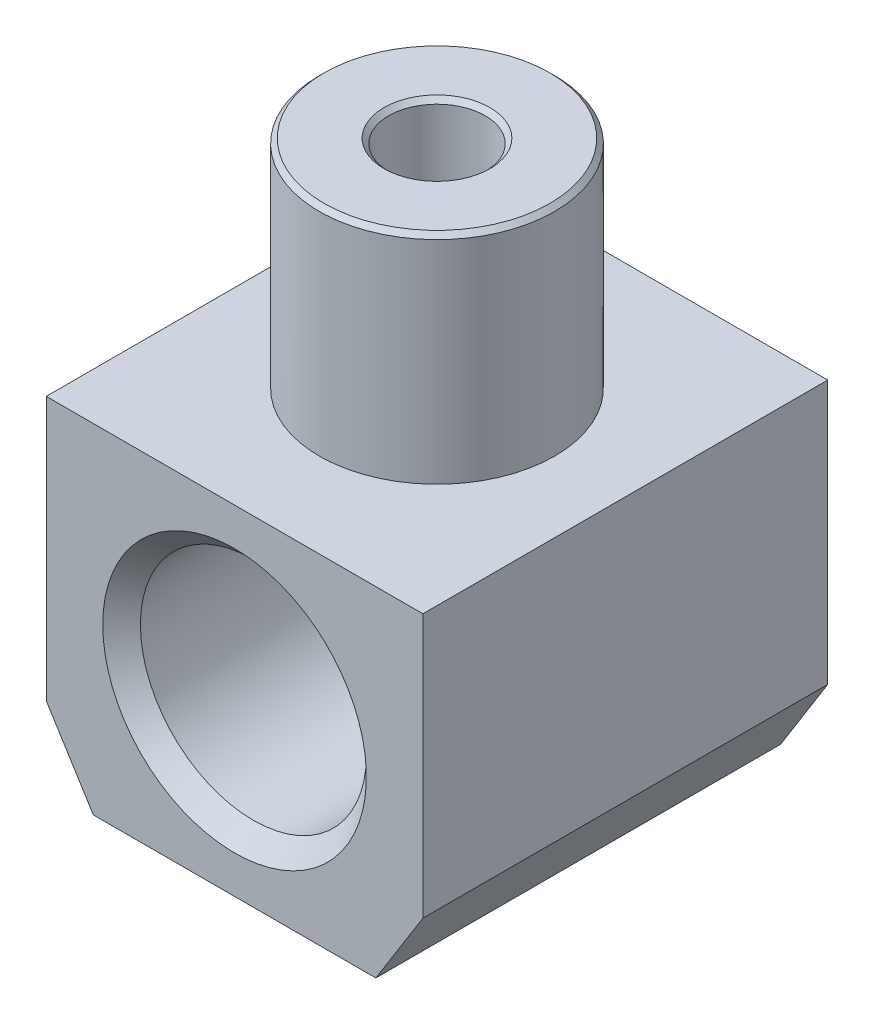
ISO-10303-21;
HEADER;
FILE_DESCRIPTION(('STEP AP214'),'2;1');
FILE_NAME('part.step','',(''),(''),'','','');
FILE_SCHEMA(('AUTOMOTIVE_DESIGN { 1 0 10303 214 1 1 1 1 }'));
ENDSEC;
DATA;
#1=APPLICATION_CONTEXT('core data for automotive mechanical design processes');
#2=APPLICATION_PROTOCOL_DEFINITION('international standard','automotive_design',2000,#1);
#3=PRODUCT_CONTEXT('',#1,'mechanical');
#4=PRODUCT('Part','Part','',(#3));
#5=PRODUCT_RELATED_PRODUCT_CATEGORY('part','',(#4));
#6=PRODUCT_DEFINITION_FORMATION('','',#4);
#7=PRODUCT_DEFINITION_CONTEXT('part definition',#1,'design');
#8=PRODUCT_DEFINITION('design','',#6,#7);
#9=PRODUCT_DEFINITION_SHAPE('','',#8);
#10=(LENGTH_UNIT() NAMED_UNIT(*) SI_UNIT(.MILLI.,.METRE.));
#11=(NAMED_UNIT(*) PLANE_ANGLE_UNIT() SI_UNIT($,.RADIAN.));
#12=(NAMED_UNIT(*) SI_UNIT($,.STERADIAN.) SOLID_ANGLE_UNIT());
#13=UNCERTAINTY_MEASURE_WITH_UNIT(LENGTH_MEASURE(1.E-05),#10,'distance_accuracy_value','');
#14=(GEOMETRIC_REPRESENTATION_CONTEXT(3) GLOBAL_UNCERTAINTY_ASSIGNED_CONTEXT((#13)) GLOBAL_UNIT_ASSIGNED_CONTEXT((#10,
#11,#12)) REPRESENTATION_CONTEXT('',''));
#15=CARTESIAN_POINT('',(0.,0.,0.));
#16=DIRECTION('',(0.,0.,1.));
#17=DIRECTION('',(1.,0.,0.));
#18=AXIS2_PLACEMENT_3D('',#15,#16,#17);
#19=CARTESIAN_POINT('',(20.,0.,-21.5));
#20=DIRECTION('',(0.,0.,-1.));
#21=DIRECTION('',(-1.,0.,0.));
#22=AXIS2_PLACEMENT_3D('',#19,#20,#21);
#23=PLANE('',#22);
#24=CARTESIAN_POINT('',(0.,-18.,-21.5));
#25=DIRECTION('',(0.,0.,-1.));
#26=DIRECTION('',(-1.,0.,0.));
#27=AXIS2_PLACEMENT_3D('',#24,#25,#26);
#28=CIRCLE('',#27,14.);
#29=CARTESIAN_POINT('',(-14.,-18.,-21.5));
#30=VERTEX_POINT('',#29);
#31=EDGE_CURVE('E470',#30,#30,#28,.F.);
#32=ORIENTED_EDGE('',*,*,#31,.T.);
#33=EDGE_LOOP('',(#32));
#34=FACE_BOUND('',#33,.T.);
#35=DIRECTION('',(0.,1.,0.));
#36=VECTOR('',#35,1.);
#37=CARTESIAN_POINT('',(20.,0.,-21.5));
#38=LINE('',#37,#36);
#39=CARTESIAN_POINT('',(20.,-28.,-21.5));
#40=VERTEX_POINT('',#39);
#41=CARTESIAN_POINT('',(20.,0.,-21.5));
#42=VERTEX_POINT('',#41);
#43=EDGE_CURVE('E412',#40,#42,#38,.T.);
#44=ORIENTED_EDGE('',*,*,#43,.F.);
#45=DIRECTION('',(0.52999894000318,0.847998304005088,0.));
#46=VECTOR('',#45,1.);
#47=CARTESIAN_POINT('',(20.,-28.,-21.5));
#48=LINE('',#47,#46);
#49=CARTESIAN_POINT('',(15.,-36.,-21.5));
#50=VERTEX_POINT('',#49);
#51=EDGE_CURVE('E425',#50,#40,#48,.T.);
#52=ORIENTED_EDGE('',*,*,#51,.F.);
#53=DIRECTION('',(1.,0.,0.));
#54=VECTOR('',#53,1.);
#55=CARTESIAN_POINT('',(-15.,-36.,-21.5));
#56=LINE('',#55,#54);
#57=CARTESIAN_POINT('',(-15.,-36.,-21.5));
#58=VERTEX_POINT('',#57);
#59=EDGE_CURVE('E423',#58,#50,#56,.T.);
#60=ORIENTED_EDGE('',*,*,#59,.F.);
#61=DIRECTION('',(0.52999894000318,-0.847998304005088,0.));
#62=VECTOR('',#61,1.);
#63=CARTESIAN_POINT('',(-20.,-28.,-21.5));
#64=LINE('',#63,#62);
#65=CARTESIAN_POINT('',(-20.,-28.,-21.5));
#66=VERTEX_POINT('',#65);
#67=EDGE_CURVE('E421',#66,#58,#64,.T.);
#68=ORIENTED_EDGE('',*,*,#67,.F.);
#69=DIRECTION('',(0.,-1.,0.));
#70=VECTOR('',#69,1.);
#71=CARTESIAN_POINT('',(-20.,-28.,-21.5));
#72=LINE('',#71,#70);
#73=CARTESIAN_POINT('',(-20.,0.,-21.5));
#74=VERTEX_POINT('',#73);
#75=EDGE_CURVE('E419',#74,#66,#72,.T.);
#76=ORIENTED_EDGE('',*,*,#75,.F.);
#77=DIRECTION('',(-1.,0.,0.));
#78=VECTOR('',#77,1.);
#79=CARTESIAN_POINT('',(20.,0.,-21.5));
#80=LINE('',#79,#78);
#81=EDGE_CURVE('E415',#42,#74,#80,.T.);
#82=ORIENTED_EDGE('',*,*,#81,.F.);
#83=EDGE_LOOP('',(#44,#52,#60,#68,#76,#82));
#84=FACE_BOUND('',#83,.T.);
#85=ADVANCED_FACE('F348',(#34,#84),#23,.T.);
#86=CARTESIAN_POINT('',(20.,0.,21.5));
#87=DIRECTION('',(0.,-1.,0.));
#88=DIRECTION('',(1.,0.,0.));
#89=AXIS2_PLACEMENT_3D('',#86,#87,#88);
#90=PLANE('',#89);
#91=ORIENTED_EDGE('',*,*,#81,.T.);
#92=DIRECTION('',(0.,0.,-1.));
#93=VECTOR('',#92,1.);
#94=CARTESIAN_POINT('',(-20.,0.,21.5));
#95=LINE('',#94,#93);
#96=CARTESIAN_POINT('',(-20.,0.,21.5));
#97=VERTEX_POINT('',#96);
#98=EDGE_CURVE('E449',#97,#74,#95,.T.);
#99=ORIENTED_EDGE('',*,*,#98,.F.);
#100=DIRECTION('',(-1.,0.,0.));
#101=VECTOR('',#100,1.);
#102=CARTESIAN_POINT('',(20.,0.,21.5));
#103=LINE('',#102,#101);
#104=CARTESIAN_POINT('',(20.,0.,21.5));
#105=VERTEX_POINT('',#104);
#106=EDGE_CURVE('E429',#105,#97,#103,.T.);
#107=ORIENTED_EDGE('',*,*,#106,.F.);
#108=DIRECTION('',(0.,0.,-1.));
#109=VECTOR('',#108,1.);
#110=CARTESIAN_POINT('',(20.,0.,21.5));
#111=LINE('',#110,#109);
#112=EDGE_CURVE('E452',#105,#42,#111,.T.);
#113=ORIENTED_EDGE('',*,*,#112,.T.);
#114=EDGE_LOOP('',(#91,#99,#107,#113));
#115=FACE_BOUND('',#114,.T.);
#116=CARTESIAN_POINT('',(0.,0.,0.));
#117=DIRECTION('',(0.,-1.,0.));
#118=DIRECTION('',(1.,0.,0.));
#119=AXIS2_PLACEMENT_3D('',#116,#117,#118);
#120=CIRCLE('',#119,12.5);
#121=CARTESIAN_POINT('',(12.5,0.,0.));
#122=VERTEX_POINT('',#121);
#123=EDGE_CURVE('E455',#122,#122,#120,.F.);
#124=ORIENTED_EDGE('',*,*,#123,.F.);
#125=EDGE_LOOP('',(#124));
#126=FACE_BOUND('',#125,.T.);
#127=ADVANCED_FACE('F490',(#115,#126),#90,.F.);
#128=CARTESIAN_POINT('',(20.,0.,21.5));
#129=DIRECTION('',(-1.,0.,0.));
#130=DIRECTION('',(0.,-1.,0.));
#131=AXIS2_PLACEMENT_3D('',#128,#129,#130);
#132=PLANE('',#131);
#133=ORIENTED_EDGE('',*,*,#43,.T.);
#134=ORIENTED_EDGE('',*,*,#112,.F.);
#135=DIRECTION('',(0.,1.,0.));
#136=VECTOR('',#135,1.);
#137=CARTESIAN_POINT('',(20.,0.,21.5));
#138=LINE('',#137,#136);
#139=CARTESIAN_POINT('',(20.,-28.,21.5));
#140=VERTEX_POINT('',#139);
#141=EDGE_CURVE('E427',#140,#105,#138,.T.);
#142=ORIENTED_EDGE('',*,*,#141,.F.);
#143=DIRECTION('',(0.,0.,-1.));
#144=VECTOR('',#143,1.);
#145=CARTESIAN_POINT('',(20.,-28.,21.5));
#146=LINE('',#145,#144);
#147=EDGE_CURVE('E437',#140,#40,#146,.T.);
#148=ORIENTED_EDGE('',*,*,#147,.T.);
#149=EDGE_LOOP('',(#133,#134,#142,#148));
#150=FACE_BOUND('',#149,.T.);
#151=ADVANCED_FACE('F350',(#150),#132,.F.);
#152=CARTESIAN_POINT('',(-20.,-28.,21.5));
#153=DIRECTION('',(1.,0.,0.));
#154=DIRECTION('',(0.,1.,0.));
#155=AXIS2_PLACEMENT_3D('',#152,#153,#154);
#156=PLANE('',#155);
#157=ORIENTED_EDGE('',*,*,#75,.T.);
#158=DIRECTION('',(0.,0.,-1.));
#159=VECTOR('',#158,1.);
#160=CARTESIAN_POINT('',(-20.,-28.,21.5));
#161=LINE('',#160,#159);
#162=CARTESIAN_POINT('',(-20.,-28.,21.5));
#163=VERTEX_POINT('',#162);
#164=EDGE_CURVE('E446',#163,#66,#161,.T.);
#165=ORIENTED_EDGE('',*,*,#164,.F.);
#166=DIRECTION('',(0.,-1.,0.));
#167=VECTOR('',#166,1.);
#168=CARTESIAN_POINT('',(-20.,-28.,21.5));
#169=LINE('',#168,#167);
#170=EDGE_CURVE('E431',#97,#163,#169,.T.);
#171=ORIENTED_EDGE('',*,*,#170,.F.);
#172=ORIENTED_EDGE('',*,*,#98,.T.);
#173=EDGE_LOOP('',(#157,#165,#171,#172));
#174=FACE_BOUND('',#173,.T.);
#175=ADVANCED_FACE('F511',(#174),#156,.F.);
#176=CARTESIAN_POINT('',(-20.,-28.,21.5));
#177=DIRECTION('',(0.847998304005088,0.52999894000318,0.));
#178=DIRECTION('',(-0.52999894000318,0.847998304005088,0.));
#179=AXIS2_PLACEMENT_3D('',#176,#177,#178);
#180=PLANE('',#179);
#181=ORIENTED_EDGE('',*,*,#67,.T.);
#182=DIRECTION('',(0.,0.,-1.));
#183=VECTOR('',#182,1.);
#184=CARTESIAN_POINT('',(-15.,-36.,21.5));
#185=LINE('',#184,#183);
#186=CARTESIAN_POINT('',(-15.,-36.,21.5));
#187=VERTEX_POINT('',#186);
#188=EDGE_CURVE('E443',#187,#58,#185,.T.);
#189=ORIENTED_EDGE('',*,*,#188,.F.);
#190=DIRECTION('',(0.52999894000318,-0.847998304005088,0.));
#191=VECTOR('',#190,1.);
#192=CARTESIAN_POINT('',(-20.,-28.,21.5));
#193=LINE('',#192,#191);
#194=EDGE_CURVE('E433',#163,#187,#193,.T.);
#195=ORIENTED_EDGE('',*,*,#194,.F.);
#196=ORIENTED_EDGE('',*,*,#164,.T.);
#197=EDGE_LOOP('',(#181,#189,#195,#196));
#198=FACE_BOUND('',#197,.T.);
#199=ADVANCED_FACE('F506',(#198),#180,.F.);
#200=CARTESIAN_POINT('',(-15.,-36.,21.5));
#201=DIRECTION('',(0.,1.,0.));
#202=DIRECTION('',(0.,0.,1.));
#203=AXIS2_PLACEMENT_3D('',#200,#201,#202);
#204=PLANE('',#203);
#205=ORIENTED_EDGE('',*,*,#59,.T.);
#206=DIRECTION('',(0.,0.,-1.));
#207=VECTOR('',#206,1.);
#208=CARTESIAN_POINT('',(15.,-36.,21.5));
#209=LINE('',#208,#207);
#210=CARTESIAN_POINT('',(15.,-36.,21.5));
#211=VERTEX_POINT('',#210);
#212=EDGE_CURVE('E440',#211,#50,#209,.T.);
#213=ORIENTED_EDGE('',*,*,#212,.F.);
#214=DIRECTION('',(1.,0.,0.));
#215=VECTOR('',#214,1.);
#216=CARTESIAN_POINT('',(-15.,-36.,21.5));
#217=LINE('',#216,#215);
#218=EDGE_CURVE('E368',#187,#211,#217,.T.);
#219=ORIENTED_EDGE('',*,*,#218,.F.);
#220=ORIENTED_EDGE('',*,*,#188,.T.);
#221=EDGE_LOOP('',(#205,#213,#219,#220));
#222=FACE_BOUND('',#221,.T.);
#223=ADVANCED_FACE('F502',(#222),#204,.F.);
#224=CARTESIAN_POINT('',(20.,-28.,21.5));
#225=DIRECTION('',(-0.847998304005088,0.52999894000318,0.));
#226=DIRECTION('',(-0.52999894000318,-0.847998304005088,0.));
#227=AXIS2_PLACEMENT_3D('',#224,#225,#226);
#228=PLANE('',#227);
#229=ORIENTED_EDGE('',*,*,#51,.T.);
#230=ORIENTED_EDGE('',*,*,#147,.F.);
#231=DIRECTION('',(0.52999894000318,0.847998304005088,0.));
#232=VECTOR('',#231,1.);
#233=CARTESIAN_POINT('',(20.,-28.,21.5));
#234=LINE('',#233,#232);
#235=EDGE_CURVE('E363',#211,#140,#234,.T.);
#236=ORIENTED_EDGE('',*,*,#235,.F.);
#237=ORIENTED_EDGE('',*,*,#212,.T.);
#238=EDGE_LOOP('',(#229,#230,#236,#237));
#239=FACE_BOUND('',#238,.T.);
#240=ADVANCED_FACE('F500',(#239),#228,.F.);
#241=CARTESIAN_POINT('',(20.,0.,21.5));
#242=DIRECTION('',(0.,0.,-1.));
#243=DIRECTION('',(-1.,0.,0.));
#244=AXIS2_PLACEMENT_3D('',#241,#242,#243);
#245=PLANE('',#244);
#246=CARTESIAN_POINT('',(0.,-18.,21.5));
#247=DIRECTION('',(0.,0.,-1.));
#248=DIRECTION('',(-1.,0.,0.));
#249=AXIS2_PLACEMENT_3D('',#246,#247,#248);
#250=CIRCLE('',#249,14.);
#251=CARTESIAN_POINT('',(-14.,-18.,21.5));
#252=VERTEX_POINT('',#251);
#253=EDGE_CURVE('E11',#252,#252,#250,.T.);
#254=ORIENTED_EDGE('',*,*,#253,.T.);
#255=EDGE_LOOP('',(#254));
#256=FACE_BOUND('',#255,.T.);
#257=ORIENTED_EDGE('',*,*,#141,.T.);
#258=ORIENTED_EDGE('',*,*,#106,.T.);
#259=ORIENTED_EDGE('',*,*,#170,.T.);
#260=ORIENTED_EDGE('',*,*,#194,.T.);
#261=ORIENTED_EDGE('',*,*,#218,.T.);
#262=ORIENTED_EDGE('',*,*,#235,.T.);
#263=EDGE_LOOP('',(#257,#258,#259,#260,#261,#262));
#264=FACE_BOUND('',#263,.T.);
#265=ADVANCED_FACE('F515',(#256,#264),#245,.F.);
#266=CARTESIAN_POINT('',(0.,23.,0.));
#267=DIRECTION('',(0.,-1.,0.));
#268=DIRECTION('',(1.,0.,0.));
#269=AXIS2_PLACEMENT_3D('',#266,#267,#268);
#270=CYLINDRICAL_SURFACE('',#269,12.5);
#271=CARTESIAN_POINT('',(0.,22.5,0.));
#272=DIRECTION('',(0.,1.,0.));
#273=DIRECTION('',(-1.,0.,0.));
#274=AXIS2_PLACEMENT_3D('',#271,#272,#273);
#275=CIRCLE('',#274,12.5);
#276=CARTESIAN_POINT('',(-12.5,22.5,0.));
#277=VERTEX_POINT('',#276);
#278=EDGE_CURVE('E461',#277,#277,#275,.F.);
#279=ORIENTED_EDGE('',*,*,#278,.T.);
#280=EDGE_LOOP('',(#279));
#281=FACE_BOUND('',#280,.T.);
#282=ORIENTED_EDGE('',*,*,#123,.T.);
#283=EDGE_LOOP('',(#282));
#284=FACE_BOUND('',#283,.T.);
#285=ADVANCED_FACE('F517',(#281,#284),#270,.T.);
#286=CARTESIAN_POINT('',(0.,23.,0.));
#287=DIRECTION('',(0.,1.,0.));
#288=DIRECTION('',(-1.,0.,0.));
#289=AXIS2_PLACEMENT_3D('',#286,#287,#288);
#290=PLANE('',#289);
#291=CARTESIAN_POINT('',(0.,23.,0.));
#292=DIRECTION('',(0.,1.,0.));
#293=DIRECTION('',(-1.,0.,0.));
#294=AXIS2_PLACEMENT_3D('',#291,#292,#293);
#295=CIRCLE('',#294,5.625);
#296=CARTESIAN_POINT('',(-5.625,23.,0.));
#297=VERTEX_POINT('',#296);
#298=EDGE_CURVE('E467',#297,#297,#295,.F.);
#299=ORIENTED_EDGE('',*,*,#298,.T.);
#300=EDGE_LOOP('',(#299));
#301=FACE_BOUND('',#300,.T.);
#302=CARTESIAN_POINT('',(0.,23.,0.));
#303=DIRECTION('',(0.,1.,0.));
#304=DIRECTION('',(-1.,0.,0.));
#305=AXIS2_PLACEMENT_3D('',#302,#303,#304);
#306=CIRCLE('',#305,12.);
#307=CARTESIAN_POINT('',(-12.,23.,0.));
#308=VERTEX_POINT('',#307);
#309=EDGE_CURVE('E458',#308,#308,#306,.T.);
#310=ORIENTED_EDGE('',*,*,#309,.T.);
#311=EDGE_LOOP('',(#310));
#312=FACE_BOUND('',#311,.T.);
#313=ADVANCED_FACE('F524',(#301,#312),#290,.T.);
#314=CARTESIAN_POINT('',(0.,23.,0.));
#315=DIRECTION('',(0.,-1.,0.));
#316=DIRECTION('',(1.,0.,0.));
#317=AXIS2_PLACEMENT_3D('',#314,#315,#316);
#318=CONICAL_SURFACE('',#317,12.,0.78539816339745);
#319=ORIENTED_EDGE('',*,*,#278,.F.);
#320=EDGE_LOOP('',(#319));
#321=FACE_BOUND('',#320,.T.);
#322=ORIENTED_EDGE('',*,*,#309,.F.);
#323=EDGE_LOOP('',(#322));
#324=FACE_BOUND('',#323,.T.);
#325=ADVANCED_FACE('F573',(#321,#324),#318,.T.);
#326=CARTESIAN_POINT('',(0.,23.,0.));
#327=DIRECTION('',(0.,1.,0.));
#328=DIRECTION('',(0.,0.,1.));
#329=AXIS2_PLACEMENT_3D('',#326,#327,#328);
#330=CYLINDRICAL_SURFACE('',#329,5.125);
#331=CARTESIAN_POINT('',(0.,22.5,0.));
#332=DIRECTION('',(0.,1.,0.));
#333=DIRECTION('',(0.,0.,1.));
#334=AXIS2_PLACEMENT_3D('',#331,#332,#333);
#335=CIRCLE('',#334,5.125);
#336=CARTESIAN_POINT('',(0.,22.5,5.125));
#337=VERTEX_POINT('',#336);
#338=EDGE_CURVE('E464',#337,#337,#335,.T.);
#339=ORIENTED_EDGE('',*,*,#338,.T.);
#340=EDGE_LOOP('',(#339));
#341=FACE_BOUND('',#340,.T.);
#342=CARTESIAN_POINT('',(0.,4.5,0.));
#343=DIRECTION('',(0.,1.,0.));
#344=DIRECTION('',(0.,0.,1.));
#345=AXIS2_PLACEMENT_3D('',#342,#343,#344);
#346=CIRCLE('',#345,5.125);
#347=CARTESIAN_POINT('',(0.,4.5,5.125));
#348=VERTEX_POINT('',#347);
#349=EDGE_CURVE('E410',#348,#348,#346,.T.);
#350=ORIENTED_EDGE('',*,*,#349,.F.);
#351=EDGE_LOOP('',(#350));
#352=FACE_BOUND('',#351,.T.);
#353=ADVANCED_FACE('F406',(#341,#352),#330,.F.);
#354=CARTESIAN_POINT('',(0.,4.5,0.));
#355=DIRECTION('',(0.,1.,0.));
#356=DIRECTION('',(0.,0.,1.));
#357=AXIS2_PLACEMENT_3D('',#354,#355,#356);
#358=CONICAL_SURFACE('',#357,5.125,1.02974425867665);
#359=CARTESIAN_POINT('',(0.,1.42058932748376,0.));
#360=VERTEX_POINT('',#359);
#361=VERTEX_LOOP('',#360);
#362=FACE_BOUND('',#361,.T.);
#363=ORIENTED_EDGE('',*,*,#349,.T.);
#364=EDGE_LOOP('',(#363));
#365=FACE_BOUND('',#364,.T.);
#366=ADVANCED_FACE('F402',(#362,#365),#358,.F.);
#367=CARTESIAN_POINT('',(0.,22.5,0.));
#368=DIRECTION('',(0.,1.,0.));
#369=DIRECTION('',(0.,0.,1.));
#370=AXIS2_PLACEMENT_3D('',#367,#368,#369);
#371=CONICAL_SURFACE('',#370,5.125,0.785398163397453);
#372=ORIENTED_EDGE('',*,*,#298,.F.);
#373=EDGE_LOOP('',(#372));
#374=FACE_BOUND('',#373,.T.);
#375=ORIENTED_EDGE('',*,*,#338,.F.);
#376=EDGE_LOOP('',(#375));
#377=FACE_BOUND('',#376,.T.);
#378=ADVANCED_FACE('F405',(#374,#377),#371,.F.);
#379=CARTESIAN_POINT('',(0.,-18.,21.5));
#380=DIRECTION('',(0.,0.,1.));
#381=DIRECTION('',(1.,0.,0.));
#382=AXIS2_PLACEMENT_3D('',#379,#380,#381);
#383=CYLINDRICAL_SURFACE('',#382,12.);
#384=CARTESIAN_POINT('',(0.,-18.,-19.5));
#385=DIRECTION('',(0.,0.,-1.));
#386=DIRECTION('',(-1.,0.,0.));
#387=AXIS2_PLACEMENT_3D('',#384,#385,#386);
#388=CIRCLE('',#387,12.);
#389=CARTESIAN_POINT('',(-12.,-18.,-19.5));
#390=VERTEX_POINT('',#389);
#391=EDGE_CURVE('E356',#390,#390,#388,.T.);
#392=ORIENTED_EDGE('',*,*,#391,.T.);
#393=EDGE_LOOP('',(#392));
#394=FACE_BOUND('',#393,.T.);
#395=CARTESIAN_POINT('',(0.,-18.,19.5));
#396=DIRECTION('',(0.,0.,-1.));
#397=DIRECTION('',(-1.,0.,0.));
#398=AXIS2_PLACEMENT_3D('',#395,#396,#397);
#399=CIRCLE('',#398,12.);
#400=CARTESIAN_POINT('',(-12.,-18.,19.5));
#401=VERTEX_POINT('',#400);
#402=EDGE_CURVE('E473',#401,#401,#399,.F.);
#403=ORIENTED_EDGE('',*,*,#402,.T.);
#404=EDGE_LOOP('',(#403));
#405=FACE_BOUND('',#404,.T.);
#406=ADVANCED_FACE('F478',(#394,#405),#383,.F.);
#407=CARTESIAN_POINT('',(0.,-18.,-21.5));
#408=DIRECTION('',(0.,0.,-1.));
#409=DIRECTION('',(-1.,0.,0.));
#410=AXIS2_PLACEMENT_3D('',#407,#408,#409);
#411=CONICAL_SURFACE('',#410,14.,0.785398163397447);
#412=ORIENTED_EDGE('',*,*,#391,.F.);
#413=EDGE_LOOP('',(#412));
#414=FACE_BOUND('',#413,.T.);
#415=ORIENTED_EDGE('',*,*,#31,.F.);
#416=EDGE_LOOP('',(#415));
#417=FACE_BOUND('',#416,.T.);
#418=ADVANCED_FACE('F481',(#414,#417),#411,.F.);
#419=CARTESIAN_POINT('',(0.,-18.,19.5));
#420=DIRECTION('',(0.,0.,1.));
#421=DIRECTION('',(1.,0.,0.));
#422=AXIS2_PLACEMENT_3D('',#419,#420,#421);
#423=CONICAL_SURFACE('',#422,12.,0.78539816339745);
#424=ORIENTED_EDGE('',*,*,#253,.F.);
#425=EDGE_LOOP('',(#424));
#426=FACE_BOUND('',#425,.T.);
#427=ORIENTED_EDGE('',*,*,#402,.F.);
#428=EDGE_LOOP('',(#427));
#429=FACE_BOUND('',#428,.T.);
#430=ADVANCED_FACE('F484',(#426,#429),#423,.F.);
#431=CLOSED_SHELL('',(#85,#127,#151,#175,#199,#223,#240,#265,#285,#313,#325,#353,#366,#378,#406,
#418,#430));
#432=MANIFOLD_SOLID_BREP('B2',#431);
#433=ADVANCED_BREP_SHAPE_REPRESENTATION('',(#18,#432),#14);
#434=SHAPE_DEFINITION_REPRESENTATION(#9,#433);
ENDSEC;
END-ISO-10303-21;
